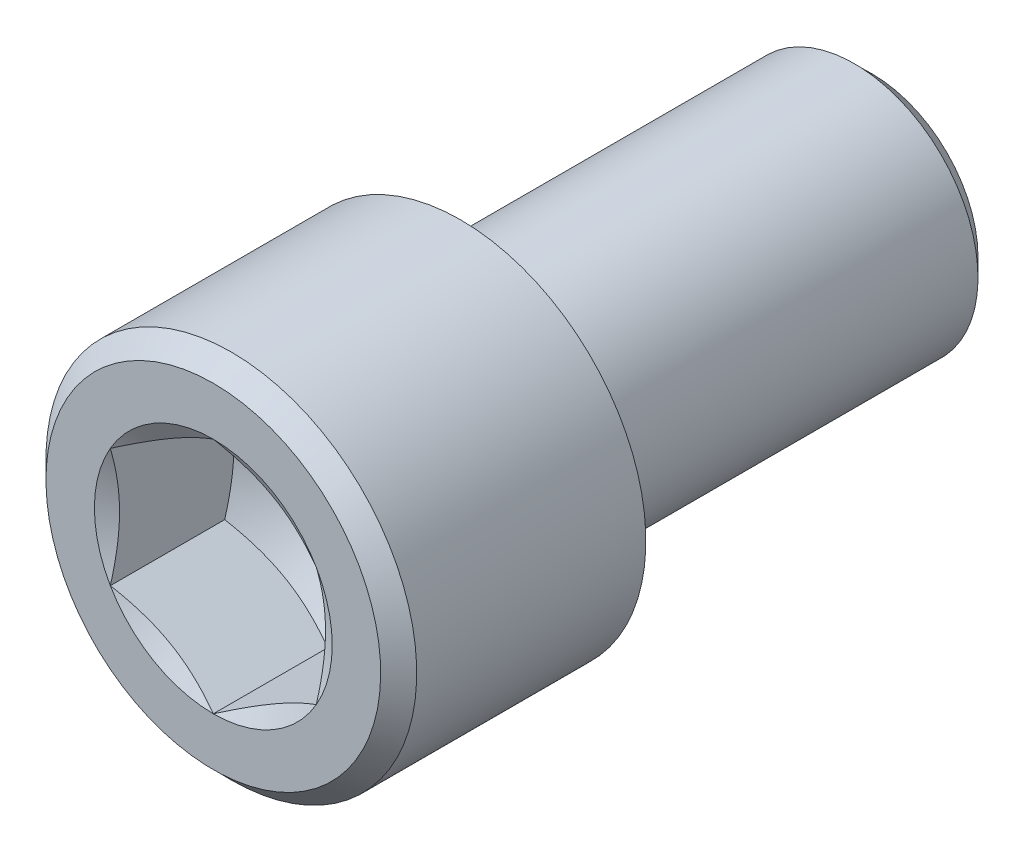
ISO-10303-21;
HEADER;
FILE_DESCRIPTION(('STEP AP214'),'2;1');
FILE_NAME('part.step','',(''),(''),'','','');
FILE_SCHEMA(('AUTOMOTIVE_DESIGN { 1 0 10303 214 1 1 1 1 }'));
ENDSEC;
DATA;
#1=APPLICATION_CONTEXT('core data for automotive mechanical design processes');
#2=APPLICATION_PROTOCOL_DEFINITION('international standard','automotive_design',2000,#1);
#3=PRODUCT_CONTEXT('',#1,'mechanical');
#4=PRODUCT('Part','Part','',(#3));
#5=PRODUCT_RELATED_PRODUCT_CATEGORY('part','',(#4));
#6=PRODUCT_DEFINITION_FORMATION('','',#4);
#7=PRODUCT_DEFINITION_CONTEXT('part definition',#1,'design');
#8=PRODUCT_DEFINITION('design','',#6,#7);
#9=PRODUCT_DEFINITION_SHAPE('','',#8);
#10=(LENGTH_UNIT() NAMED_UNIT(*) SI_UNIT(.MILLI.,.METRE.));
#11=(NAMED_UNIT(*) PLANE_ANGLE_UNIT() SI_UNIT($,.RADIAN.));
#12=(NAMED_UNIT(*) SI_UNIT($,.STERADIAN.) SOLID_ANGLE_UNIT());
#13=UNCERTAINTY_MEASURE_WITH_UNIT(LENGTH_MEASURE(1.E-05),#10,'distance_accuracy_value','');
#14=(GEOMETRIC_REPRESENTATION_CONTEXT(3) GLOBAL_UNCERTAINTY_ASSIGNED_CONTEXT((#13)) GLOBAL_UNIT_ASSIGNED_CONTEXT((#10,
#11,#12)) REPRESENTATION_CONTEXT('',''));
#15=CARTESIAN_POINT('',(0.,0.,0.));
#16=DIRECTION('',(0.,0.,1.));
#17=DIRECTION('',(1.,0.,0.));
#18=AXIS2_PLACEMENT_3D('',#15,#16,#17);
#19=CARTESIAN_POINT('',(0.,9.,12.));
#20=DIRECTION('',(0.,0.,-1.));
#21=DIRECTION('',(0.,1.,0.));
#22=AXIS2_PLACEMENT_3D('',#19,#20,#21);
#23=PLANE('',#22);
#24=CARTESIAN_POINT('',(0.,0.,12.));
#25=DIRECTION('',(0.,0.,-1.));
#26=DIRECTION('',(0.,1.,0.));
#27=AXIS2_PLACEMENT_3D('',#24,#25,#26);
#28=CIRCLE('',#27,8.12499999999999);
#29=CARTESIAN_POINT('',(0.,8.12499999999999,12.));
#30=VERTEX_POINT('',#29);
#31=EDGE_CURVE('E299',#30,#30,#28,.F.);
#32=ORIENTED_EDGE('',*,*,#31,.T.);
#33=EDGE_LOOP('',(#32));
#34=FACE_BOUND('',#33,.T.);
#35=CARTESIAN_POINT('',(0.,0.,12.));
#36=DIRECTION('',(0.,0.,-1.));
#37=DIRECTION('',(0.,1.,0.));
#38=AXIS2_PLACEMENT_3D('',#35,#36,#37);
#39=CIRCLE('',#38,5.77350269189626);
#40=CARTESIAN_POINT('',(0.,5.77350269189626,12.));
#41=VERTEX_POINT('',#40);
#42=CARTESIAN_POINT('',(-5.,2.88675134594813,12.));
#43=VERTEX_POINT('',#42);
#44=EDGE_CURVE('E111',#41,#43,#39,.F.);
#45=ORIENTED_EDGE('',*,*,#44,.F.);
#46=CARTESIAN_POINT('',(5.,2.88675134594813,12.));
#47=VERTEX_POINT('',#46);
#48=EDGE_CURVE('E99',#47,#41,#39,.F.);
#49=ORIENTED_EDGE('',*,*,#48,.F.);
#50=CARTESIAN_POINT('',(5.,-2.88675134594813,12.));
#51=VERTEX_POINT('',#50);
#52=EDGE_CURVE('E109',#51,#47,#39,.F.);
#53=ORIENTED_EDGE('',*,*,#52,.F.);
#54=CARTESIAN_POINT('',(0.,-5.77350269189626,12.));
#55=VERTEX_POINT('',#54);
#56=EDGE_CURVE('E463',#55,#51,#39,.F.);
#57=ORIENTED_EDGE('',*,*,#56,.F.);
#58=CARTESIAN_POINT('',(-5.,-2.88675134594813,12.));
#59=VERTEX_POINT('',#58);
#60=EDGE_CURVE('E145',#59,#55,#39,.F.);
#61=ORIENTED_EDGE('',*,*,#60,.F.);
#62=EDGE_CURVE('E141',#43,#59,#39,.F.);
#63=ORIENTED_EDGE('',*,*,#62,.F.);
#64=EDGE_LOOP('',(#45,#49,#53,#57,#61,#63));
#65=FACE_BOUND('',#64,.T.);
#66=ADVANCED_FACE('F42',(#34,#65),#23,.F.);
#67=CARTESIAN_POINT('',(0.,6.,0.));
#68=DIRECTION('',(0.,0.,1.));
#69=DIRECTION('',(0.,-1.,0.));
#70=AXIS2_PLACEMENT_3D('',#67,#68,#69);
#71=PLANE('',#70);
#72=CARTESIAN_POINT('',(0.,0.,0.));
#73=DIRECTION('',(0.,0.,1.));
#74=DIRECTION('',(0.,-1.,0.));
#75=AXIS2_PLACEMENT_3D('',#72,#73,#74);
#76=CIRCLE('',#75,6.4);
#77=CARTESIAN_POINT('',(0.,-6.4,0.));
#78=VERTEX_POINT('',#77);
#79=EDGE_CURVE('E51',#78,#78,#76,.T.);
#80=ORIENTED_EDGE('',*,*,#79,.T.);
#81=EDGE_LOOP('',(#80));
#82=FACE_BOUND('',#81,.T.);
#83=CARTESIAN_POINT('',(0.,0.,0.));
#84=DIRECTION('',(0.,0.,1.));
#85=DIRECTION('',(0.,-1.,0.));
#86=AXIS2_PLACEMENT_3D('',#83,#84,#85);
#87=CIRCLE('',#86,9.);
#88=CARTESIAN_POINT('',(0.,-9.,0.));
#89=VERTEX_POINT('',#88);
#90=EDGE_CURVE('E431',#89,#89,#87,.T.);
#91=ORIENTED_EDGE('',*,*,#90,.F.);
#92=EDGE_LOOP('',(#91));
#93=FACE_BOUND('',#92,.T.);
#94=ADVANCED_FACE('F259',(#82,#93),#71,.F.);
#95=CARTESIAN_POINT('',(0.,0.,12.));
#96=DIRECTION('',(0.,0.,1.));
#97=DIRECTION('',(0.,-1.,0.));
#98=AXIS2_PLACEMENT_3D('',#95,#96,#97);
#99=CYLINDRICAL_SURFACE('',#98,6.);
#100=CARTESIAN_POINT('',(0.,0.,-0.399999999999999));
#101=DIRECTION('',(0.,0.,1.));
#102=DIRECTION('',(0.,-1.,0.));
#103=AXIS2_PLACEMENT_3D('',#100,#101,#102);
#104=CIRCLE('',#103,6.);
#105=CARTESIAN_POINT('',(0.,-6.,-0.399999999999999));
#106=VERTEX_POINT('',#105);
#107=EDGE_CURVE('E12',#106,#106,#104,.F.);
#108=ORIENTED_EDGE('',*,*,#107,.T.);
#109=EDGE_LOOP('',(#108));
#110=FACE_BOUND('',#109,.T.);
#111=CARTESIAN_POINT('',(0.,0.,-19.125));
#112=DIRECTION('',(0.,0.,1.));
#113=DIRECTION('',(0.,-1.,0.));
#114=AXIS2_PLACEMENT_3D('',#111,#112,#113);
#115=CIRCLE('',#114,6.);
#116=CARTESIAN_POINT('',(0.,-6.,-19.125));
#117=VERTEX_POINT('',#116);
#118=EDGE_CURVE('E289',#117,#117,#115,.T.);
#119=ORIENTED_EDGE('',*,*,#118,.T.);
#120=EDGE_LOOP('',(#119));
#121=FACE_BOUND('',#120,.T.);
#122=ADVANCED_FACE('F263',(#110,#121),#99,.T.);
#123=CARTESIAN_POINT('',(0.,0.,-20.));
#124=DIRECTION('',(0.,0.,1.));
#125=DIRECTION('',(0.,-1.,0.));
#126=AXIS2_PLACEMENT_3D('',#123,#124,#125);
#127=PLANE('',#126);
#128=CARTESIAN_POINT('',(0.,0.,-20.));
#129=DIRECTION('',(0.,0.,1.));
#130=DIRECTION('',(0.,-1.,0.));
#131=AXIS2_PLACEMENT_3D('',#128,#129,#130);
#132=CIRCLE('',#131,5.125);
#133=CARTESIAN_POINT('',(0.,-5.125,-20.));
#134=VERTEX_POINT('',#133);
#135=EDGE_CURVE('E122',#134,#134,#132,.F.);
#136=ORIENTED_EDGE('',*,*,#135,.T.);
#137=EDGE_LOOP('',(#136));
#138=FACE_BOUND('',#137,.T.);
#139=ADVANCED_FACE('F268',(#138),#127,.F.);
#140=CARTESIAN_POINT('',(0.,0.,12.));
#141=DIRECTION('',(0.,0.,1.));
#142=DIRECTION('',(0.,-1.,0.));
#143=AXIS2_PLACEMENT_3D('',#140,#141,#142);
#144=CYLINDRICAL_SURFACE('',#143,9.);
#145=CARTESIAN_POINT('',(0.,0.,11.125));
#146=DIRECTION('',(0.,0.,-1.));
#147=DIRECTION('',(0.,1.,0.));
#148=AXIS2_PLACEMENT_3D('',#145,#146,#147);
#149=CIRCLE('',#148,9.);
#150=CARTESIAN_POINT('',(0.,9.,11.125));
#151=VERTEX_POINT('',#150);
#152=EDGE_CURVE('E292',#151,#151,#149,.T.);
#153=ORIENTED_EDGE('',*,*,#152,.T.);
#154=EDGE_LOOP('',(#153));
#155=FACE_BOUND('',#154,.T.);
#156=ORIENTED_EDGE('',*,*,#90,.T.);
#157=EDGE_LOOP('',(#156));
#158=FACE_BOUND('',#157,.T.);
#159=ADVANCED_FACE('F180',(#155,#158),#144,.T.);
#160=CARTESIAN_POINT('',(0.,0.,12.));
#161=DIRECTION('',(0.,0.,-1.));
#162=DIRECTION('',(0.,1.,0.));
#163=AXIS2_PLACEMENT_3D('',#160,#161,#162);
#164=CONICAL_SURFACE('',#163,8.12499999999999,0.785398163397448);
#165=ORIENTED_EDGE('',*,*,#152,.F.);
#166=EDGE_LOOP('',(#165));
#167=FACE_BOUND('',#166,.T.);
#168=ORIENTED_EDGE('',*,*,#31,.F.);
#169=EDGE_LOOP('',(#168));
#170=FACE_BOUND('',#169,.T.);
#171=ADVANCED_FACE('F275',(#167,#170),#164,.T.);
#172=CARTESIAN_POINT('',(0.,0.,-19.125));
#173=DIRECTION('',(0.,0.,1.));
#174=DIRECTION('',(0.,-1.,0.));
#175=AXIS2_PLACEMENT_3D('',#172,#173,#174);
#176=CONICAL_SURFACE('',#175,6.,0.785398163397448);
#177=ORIENTED_EDGE('',*,*,#135,.F.);
#178=EDGE_LOOP('',(#177));
#179=FACE_BOUND('',#178,.T.);
#180=ORIENTED_EDGE('',*,*,#118,.F.);
#181=EDGE_LOOP('',(#180));
#182=FACE_BOUND('',#181,.T.);
#183=ADVANCED_FACE('F277',(#179,#182),#176,.T.);
#184=CARTESIAN_POINT('',(0.,0.,11.5534180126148));
#185=DIRECTION('',(0.,0.,1.));
#186=DIRECTION('',(0.,-1.,0.));
#187=AXIS2_PLACEMENT_3D('',#184,#185,#186);
#188=CONICAL_SURFACE('',#187,5.,1.04719755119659);
#189=ORIENTED_EDGE('',*,*,#44,.T.);
#190=CARTESIAN_POINT('',(-5.0002,2.88663587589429,12.0000666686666));
#191=CARTESIAN_POINT('',(-4.78046540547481,3.01349970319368,11.9268045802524));
#192=CARTESIAN_POINT('',(-4.55885141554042,3.14144859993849,11.8601693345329));
#193=CARTESIAN_POINT('',(-4.11178600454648,3.39956193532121,11.7438570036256));
#194=CARTESIAN_POINT('',(-3.88632664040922,3.52973095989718,11.6942210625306));
#195=CARTESIAN_POINT('',(-3.43816769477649,3.78847564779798,11.6169690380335));
#196=CARTESIAN_POINT('',(-3.2155379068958,3.91701101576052,11.5888383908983));
#197=CARTESIAN_POINT('',(-2.88081009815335,4.11026620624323,11.5636129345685));
#198=CARTESIAN_POINT('',(-2.76915780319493,4.17472868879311,11.5580314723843));
#199=CARTESIAN_POINT('',(-2.5457500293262,4.30371322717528,11.5526202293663));
#200=CARTESIAN_POINT('',(-2.43399455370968,4.36823528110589,11.552790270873));
#201=CARTESIAN_POINT('',(-2.12781576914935,4.54500768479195,11.5611716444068));
#202=CARTESIAN_POINT('',(-1.93349391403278,4.65719946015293,11.575247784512));
#203=CARTESIAN_POINT('',(-1.54613989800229,4.88083840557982,11.6198832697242));
#204=CARTESIAN_POINT('',(-1.35310909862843,4.99228478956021,11.6504578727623));
#205=CARTESIAN_POINT('',(-0.964974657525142,5.21637431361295,11.726886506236));
#206=CARTESIAN_POINT('',(-0.769920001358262,5.32898917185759,11.7730643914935));
#207=CARTESIAN_POINT('',(-0.38271965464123,5.55253939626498,11.8778698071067));
#208=CARTESIAN_POINT('',(-0.190569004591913,5.66347762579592,11.9364727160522));
#209=CARTESIAN_POINT('',(0.000200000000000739,5.7736181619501,12.0000666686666));
#210=B_SPLINE_CURVE_WITH_KNOTS('',3,(#190,#191,#192,#193,#194,#195,#196,#197,#198,#199,#200,
#201,#202,#203,#204,#205,#206,#207,#208,#209),.UNSPECIFIED.,.F.,.F.,(4,2,2,2,2,2,2,2,2,4),(0.,
0.792555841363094,1.58701660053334,2.36181537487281,2.74884076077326,3.13585419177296,
3.8096236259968,4.4840172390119,5.17336882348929,5.86136694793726),.UNSPECIFIED.);
#211=EDGE_CURVE('E115',#43,#41,#210,.T.);
#212=ORIENTED_EDGE('',*,*,#211,.T.);
#213=EDGE_LOOP('',(#189,#212));
#214=FACE_BOUND('',#213,.T.);
#215=ADVANCED_FACE('F116',(#214),#188,.F.);
#216=ORIENTED_EDGE('',*,*,#62,.T.);
#217=CARTESIAN_POINT('',(-5.,-7.65608998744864,13.9460515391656));
#218=CARTESIAN_POINT('',(-5.,-7.43656171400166,13.8399633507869));
#219=CARTESIAN_POINT('',(-5.,-7.21651440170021,13.7349297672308));
#220=CARTESIAN_POINT('',(-5.,-6.77510105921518,13.5275744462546));
#221=CARTESIAN_POINT('',(-5.,-6.55373480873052,13.4252531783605));
#222=CARTESIAN_POINT('',(-5.,-6.10820714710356,13.2233860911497));
#223=CARTESIAN_POINT('',(-5.,-5.88403698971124,13.1238595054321));
#224=CARTESIAN_POINT('',(-5.,-5.43385418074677,12.9290812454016));
#225=CARTESIAN_POINT('',(-5.,-5.20784162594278,12.8338293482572));
#226=CARTESIAN_POINT('',(-5.,-4.75080884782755,12.6476063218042));
#227=CARTESIAN_POINT('',(-5.,-4.51976121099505,12.5567021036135));
#228=CARTESIAN_POINT('',(-5.,-4.05494053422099,12.3820133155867));
#229=CARTESIAN_POINT('',(-5.,-3.82116719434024,12.2982295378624));
#230=CARTESIAN_POINT('',(-5.,-3.35100416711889,12.1400326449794));
#231=CARTESIAN_POINT('',(-5.,-3.11462125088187,12.0655996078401));
#232=CARTESIAN_POINT('',(-5.,-2.63849247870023,11.9285224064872));
#233=CARTESIAN_POINT('',(-5.,-2.3987477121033,11.8658745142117));
#234=CARTESIAN_POINT('',(-5.,-1.91574303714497,11.7554057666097));
#235=CARTESIAN_POINT('',(-5.,-1.67248221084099,11.7075888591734));
#236=CARTESIAN_POINT('',(-5.,-1.18299359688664,11.6300135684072));
#237=CARTESIAN_POINT('',(-5.,-0.936765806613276,11.6002552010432));
#238=CARTESIAN_POINT('',(-5.,-0.567032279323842,11.5710692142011));
#239=CARTESIAN_POINT('',(-5.,-0.444105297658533,11.5639143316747));
#240=CARTESIAN_POINT('',(-5.,-0.198053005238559,11.5548134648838));
#241=CARTESIAN_POINT('',(-5.,-0.074927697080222,11.5528674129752));
#242=CARTESIAN_POINT('',(-5.,0.17125799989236,11.5542364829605));
#243=CARTESIAN_POINT('',(-5.,0.294318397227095,11.5575501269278));
#244=CARTESIAN_POINT('',(-5.,0.540192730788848,11.5693546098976));
#245=CARTESIAN_POINT('',(-5.,0.66300665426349,11.577845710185));
#246=CARTESIAN_POINT('',(-5.,0.960681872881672,11.6045243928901));
#247=CARTESIAN_POINT('',(-5.,1.1353143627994,11.6253069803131));
#248=CARTESIAN_POINT('',(-5.,1.48321675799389,11.6761836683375));
#249=CARTESIAN_POINT('',(-5.,1.65648647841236,11.7062790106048));
#250=CARTESIAN_POINT('',(-5.,2.00155426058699,11.7747168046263));
#251=CARTESIAN_POINT('',(-5.,2.17335067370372,11.8130674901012));
#252=CARTESIAN_POINT('',(-5.,2.51518168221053,11.8968463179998));
#253=CARTESIAN_POINT('',(-5.,2.68521638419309,11.9422740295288));
#254=CARTESIAN_POINT('',(-5.,3.0277031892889,12.0403057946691));
#255=CARTESIAN_POINT('',(-5.,3.2001124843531,12.0930583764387));
#256=CARTESIAN_POINT('',(-5.,3.54310870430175,12.2037757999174));
#257=CARTESIAN_POINT('',(-5.,3.71369679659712,12.2617370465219));
#258=CARTESIAN_POINT('',(-5.,4.05236610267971,12.3816745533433));
#259=CARTESIAN_POINT('',(-5.,4.22045602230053,12.4436263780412));
#260=CARTESIAN_POINT('',(-5.,4.55533171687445,12.5711662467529));
#261=CARTESIAN_POINT('',(-5.,4.72211693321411,12.6367557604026));
#262=CARTESIAN_POINT('',(-5.,4.88829623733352,12.703804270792));
#263=B_SPLINE_CURVE_WITH_KNOTS('',3,(#217,#218,#219,#220,#221,#222,#223,#224,#225,#226,#227,
#228,#229,#230,#231,#232,#233,#234,#235,#236,#237,#238,#239,#240,#241,#242,#243,#244,#245,#246,
#247,#248,#249,#250,#251,#252,#253,#254,#255,#256,#257,#258,#259,#260,#261,#262),.UNSPECIFIED.,
.F.,.F.,(4,2,2,2,2,2,2,2,2,2,2,2,2,2,2,2,2,2,2,2,2,2,4),(0.,0.731464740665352,1.46305528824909,
2.19883243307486,2.93457117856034,3.67934251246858,4.42419659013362,5.1674358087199,
5.91043951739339,6.65364083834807,7.39684281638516,7.76615414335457,8.13546067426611,
8.50466345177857,8.87388486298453,9.40118542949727,9.92855633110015,10.4564556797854,
10.9843228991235,11.525120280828,12.065547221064,12.6029322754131,13.1405360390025),.UNSPECIFIED.);
#264=EDGE_CURVE('E242',#59,#43,#263,.T.);
#265=ORIENTED_EDGE('',*,*,#264,.T.);
#266=EDGE_LOOP('',(#216,#265));
#267=FACE_BOUND('',#266,.T.);
#268=ADVANCED_FACE('F283',(#267),#188,.F.);
#269=ORIENTED_EDGE('',*,*,#60,.T.);
#270=CARTESIAN_POINT('',(0.000200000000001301,-5.7736181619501,12.0000666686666));
#271=CARTESIAN_POINT('',(-0.219534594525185,-5.64675433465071,11.9268045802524));
#272=CARTESIAN_POINT('',(-0.44114858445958,-5.5188054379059,11.8601693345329));
#273=CARTESIAN_POINT('',(-0.888213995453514,-5.26069210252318,11.7438570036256));
#274=CARTESIAN_POINT('',(-1.11367335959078,-5.13052307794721,11.6942210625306));
#275=CARTESIAN_POINT('',(-1.56183230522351,-4.87177839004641,11.6169690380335));
#276=CARTESIAN_POINT('',(-1.7844620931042,-4.74324302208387,11.5888383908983));
#277=CARTESIAN_POINT('',(-2.11918990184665,-4.54998783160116,11.5636129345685));
#278=CARTESIAN_POINT('',(-2.23084219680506,-4.48552534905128,11.5580314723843));
#279=CARTESIAN_POINT('',(-2.4542499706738,-4.35654081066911,11.5526202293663));
#280=CARTESIAN_POINT('',(-2.56600544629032,-4.2920187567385,11.552790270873));
#281=CARTESIAN_POINT('',(-2.87218423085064,-4.11524635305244,11.5611716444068));
#282=CARTESIAN_POINT('',(-3.06650608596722,-4.00305457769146,11.575247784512));
#283=CARTESIAN_POINT('',(-3.45386010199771,-3.77941563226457,11.6198832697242));
#284=CARTESIAN_POINT('',(-3.64689090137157,-3.66796924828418,11.6504578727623));
#285=CARTESIAN_POINT('',(-4.03502534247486,-3.44387972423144,11.726886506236));
#286=CARTESIAN_POINT('',(-4.23007999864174,-3.3312648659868,11.7730643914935));
#287=CARTESIAN_POINT('',(-4.61728034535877,-3.1077146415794,11.8778698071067));
#288=CARTESIAN_POINT('',(-4.80943099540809,-2.99677641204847,11.9364727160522));
#289=CARTESIAN_POINT('',(-5.0002,-2.88663587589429,12.0000666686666));
#290=B_SPLINE_CURVE_WITH_KNOTS('',3,(#270,#271,#272,#273,#274,#275,#276,#277,#278,#279,#280,
#281,#282,#283,#284,#285,#286,#287,#288,#289),.UNSPECIFIED.,.F.,.F.,(4,2,2,2,2,2,2,2,2,4),(0.,
0.792555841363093,1.58701660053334,2.36181537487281,2.74884076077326,3.13585419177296,
3.8096236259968,4.4840172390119,5.17336882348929,5.86136694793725),.UNSPECIFIED.);
#291=EDGE_CURVE('E235',#55,#59,#290,.T.);
#292=ORIENTED_EDGE('',*,*,#291,.T.);
#293=EDGE_LOOP('',(#269,#292));
#294=FACE_BOUND('',#293,.T.);
#295=ADVANCED_FACE('F377',(#294),#188,.F.);
#296=ORIENTED_EDGE('',*,*,#56,.T.);
#297=CARTESIAN_POINT('',(5.0002,-2.88663587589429,12.0000666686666));
#298=CARTESIAN_POINT('',(4.78046540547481,-3.01349970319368,11.9268045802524));
#299=CARTESIAN_POINT('',(4.55885141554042,-3.14144859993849,11.8601693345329));
#300=CARTESIAN_POINT('',(4.11178600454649,-3.39956193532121,11.7438570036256));
#301=CARTESIAN_POINT('',(3.88632664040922,-3.52973095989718,11.6942210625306));
#302=CARTESIAN_POINT('',(3.43816769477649,-3.78847564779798,11.6169690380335));
#303=CARTESIAN_POINT('',(3.2155379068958,-3.91701101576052,11.5888383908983));
#304=CARTESIAN_POINT('',(2.88081009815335,-4.11026620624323,11.5636129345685));
#305=CARTESIAN_POINT('',(2.76915780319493,-4.17472868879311,11.5580314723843));
#306=CARTESIAN_POINT('',(2.5457500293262,-4.30371322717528,11.5526202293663));
#307=CARTESIAN_POINT('',(2.43399455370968,-4.36823528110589,11.552790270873));
#308=CARTESIAN_POINT('',(2.12781576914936,-4.54500768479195,11.5611716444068));
#309=CARTESIAN_POINT('',(1.93349391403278,-4.65719946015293,11.575247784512));
#310=CARTESIAN_POINT('',(1.54613989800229,-4.88083840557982,11.6198832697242));
#311=CARTESIAN_POINT('',(1.35310909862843,-4.99228478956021,11.6504578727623));
#312=CARTESIAN_POINT('',(0.964974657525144,-5.21637431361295,11.726886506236));
#313=CARTESIAN_POINT('',(0.769920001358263,-5.32898917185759,11.7730643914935));
#314=CARTESIAN_POINT('',(0.382719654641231,-5.55253939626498,11.8778698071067));
#315=CARTESIAN_POINT('',(0.190569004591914,-5.66347762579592,11.9364727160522));
#316=CARTESIAN_POINT('',(-0.00019999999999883,-5.7736181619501,12.0000666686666));
#317=B_SPLINE_CURVE_WITH_KNOTS('',3,(#297,#298,#299,#300,#301,#302,#303,#304,#305,#306,#307,
#308,#309,#310,#311,#312,#313,#314,#315,#316),.UNSPECIFIED.,.F.,.F.,(4,2,2,2,2,2,2,2,2,4),(0.,
0.792555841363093,1.58701660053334,2.36181537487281,2.74884076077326,3.13585419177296,
3.8096236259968,4.4840172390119,5.17336882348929,5.86136694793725),.UNSPECIFIED.);
#318=EDGE_CURVE('E63',#51,#55,#317,.T.);
#319=ORIENTED_EDGE('',*,*,#318,.T.);
#320=EDGE_LOOP('',(#296,#319));
#321=FACE_BOUND('',#320,.T.);
#322=ADVANCED_FACE('F370',(#321),#188,.F.);
#323=ORIENTED_EDGE('',*,*,#52,.T.);
#324=CARTESIAN_POINT('',(5.,-7.65608998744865,13.9460515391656));
#325=CARTESIAN_POINT('',(5.,-7.43656171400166,13.8399633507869));
#326=CARTESIAN_POINT('',(5.,-7.21651440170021,13.7349297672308));
#327=CARTESIAN_POINT('',(5.,-6.77510105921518,13.5275744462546));
#328=CARTESIAN_POINT('',(5.,-6.55373480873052,13.4252531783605));
#329=CARTESIAN_POINT('',(5.,-6.10820714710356,13.2233860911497));
#330=CARTESIAN_POINT('',(5.,-5.88403698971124,13.1238595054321));
#331=CARTESIAN_POINT('',(5.,-5.43385418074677,12.9290812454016));
#332=CARTESIAN_POINT('',(5.,-5.20784162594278,12.8338293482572));
#333=CARTESIAN_POINT('',(5.,-4.75080884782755,12.6476063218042));
#334=CARTESIAN_POINT('',(5.,-4.51976121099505,12.5567021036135));
#335=CARTESIAN_POINT('',(5.,-4.05494053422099,12.3820133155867));
#336=CARTESIAN_POINT('',(5.,-3.82116719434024,12.2982295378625));
#337=CARTESIAN_POINT('',(5.,-3.35100416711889,12.1400326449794));
#338=CARTESIAN_POINT('',(5.,-3.11462125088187,12.0655996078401));
#339=CARTESIAN_POINT('',(5.,-2.63849247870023,11.9285224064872));
#340=CARTESIAN_POINT('',(5.,-2.3987477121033,11.8658745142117));
#341=CARTESIAN_POINT('',(5.,-1.91574303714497,11.7554057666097));
#342=CARTESIAN_POINT('',(5.,-1.67248221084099,11.7075888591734));
#343=CARTESIAN_POINT('',(5.,-1.18299359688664,11.6300135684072));
#344=CARTESIAN_POINT('',(5.,-0.936765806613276,11.6002552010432));
#345=CARTESIAN_POINT('',(5.,-0.567032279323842,11.5710692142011));
#346=CARTESIAN_POINT('',(5.,-0.444105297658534,11.5639143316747));
#347=CARTESIAN_POINT('',(5.,-0.198053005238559,11.5548134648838));
#348=CARTESIAN_POINT('',(5.,-0.0749276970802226,11.5528674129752));
#349=CARTESIAN_POINT('',(5.,0.17125799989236,11.5542364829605));
#350=CARTESIAN_POINT('',(5.,0.294318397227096,11.5575501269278));
#351=CARTESIAN_POINT('',(5.,0.540192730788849,11.5693546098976));
#352=CARTESIAN_POINT('',(5.,0.663006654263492,11.577845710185));
#353=CARTESIAN_POINT('',(5.,0.960681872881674,11.6045243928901));
#354=CARTESIAN_POINT('',(5.,1.1353143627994,11.6253069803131));
#355=CARTESIAN_POINT('',(5.,1.48321675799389,11.6761836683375));
#356=CARTESIAN_POINT('',(5.,1.65648647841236,11.7062790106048));
#357=CARTESIAN_POINT('',(5.,2.00155426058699,11.7747168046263));
#358=CARTESIAN_POINT('',(5.,2.17335067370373,11.8130674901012));
#359=CARTESIAN_POINT('',(5.,2.51518168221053,11.8968463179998));
#360=CARTESIAN_POINT('',(5.,2.6852163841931,11.9422740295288));
#361=CARTESIAN_POINT('',(5.,3.02770318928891,12.0403057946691));
#362=CARTESIAN_POINT('',(5.,3.20011248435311,12.0930583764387));
#363=CARTESIAN_POINT('',(5.,3.54310870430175,12.2037757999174));
#364=CARTESIAN_POINT('',(5.,3.71369679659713,12.2617370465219));
#365=CARTESIAN_POINT('',(5.,4.05236610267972,12.3816745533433));
#366=CARTESIAN_POINT('',(5.,4.22045602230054,12.4436263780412));
#367=CARTESIAN_POINT('',(5.,4.55533171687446,12.5711662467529));
#368=CARTESIAN_POINT('',(5.,4.72211693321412,12.6367557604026));
#369=CARTESIAN_POINT('',(5.,4.88829623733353,12.703804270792));
#370=B_SPLINE_CURVE_WITH_KNOTS('',3,(#324,#325,#326,#327,#328,#329,#330,#331,#332,#333,#334,
#335,#336,#337,#338,#339,#340,#341,#342,#343,#344,#345,#346,#347,#348,#349,#350,#351,#352,#353,
#354,#355,#356,#357,#358,#359,#360,#361,#362,#363,#364,#365,#366,#367,#368,#369),.UNSPECIFIED.,
.F.,.F.,(4,2,2,2,2,2,2,2,2,2,2,2,2,2,2,2,2,2,2,2,2,2,4),(0.,0.731464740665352,1.46305528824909,
2.19883243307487,2.93457117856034,3.67934251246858,4.42419659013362,5.1674358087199,
5.91043951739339,6.65364083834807,7.39684281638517,7.76615414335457,8.13546067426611,
8.50466345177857,8.87388486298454,9.40118542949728,9.92855633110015,10.4564556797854,
10.9843228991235,11.525120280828,12.065547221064,12.6029322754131,13.1405360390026),.UNSPECIFIED.);
#371=EDGE_CURVE('E57',#47,#51,#370,.F.);
#372=ORIENTED_EDGE('',*,*,#371,.T.);
#373=EDGE_LOOP('',(#323,#372));
#374=FACE_BOUND('',#373,.T.);
#375=ADVANCED_FACE('F363',(#374),#188,.F.);
#376=ORIENTED_EDGE('',*,*,#48,.T.);
#377=CARTESIAN_POINT('',(-0.000200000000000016,5.7736181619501,12.0000666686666));
#378=CARTESIAN_POINT('',(0.219534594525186,5.64675433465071,11.9268045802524));
#379=CARTESIAN_POINT('',(0.441148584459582,5.5188054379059,11.8601693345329));
#380=CARTESIAN_POINT('',(0.888213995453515,5.26069210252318,11.7438570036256));
#381=CARTESIAN_POINT('',(1.11367335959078,5.13052307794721,11.6942210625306));
#382=CARTESIAN_POINT('',(1.56183230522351,4.87177839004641,11.6169690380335));
#383=CARTESIAN_POINT('',(1.7844620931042,4.74324302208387,11.5888383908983));
#384=CARTESIAN_POINT('',(2.11918990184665,4.54998783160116,11.5636129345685));
#385=CARTESIAN_POINT('',(2.23084219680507,4.48552534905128,11.5580314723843));
#386=CARTESIAN_POINT('',(2.4542499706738,4.35654081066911,11.5526202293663));
#387=CARTESIAN_POINT('',(2.56600544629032,4.2920187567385,11.552790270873));
#388=CARTESIAN_POINT('',(2.87218423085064,4.11524635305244,11.5611716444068));
#389=CARTESIAN_POINT('',(3.06650608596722,4.00305457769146,11.575247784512));
#390=CARTESIAN_POINT('',(3.45386010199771,3.77941563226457,11.6198832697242));
#391=CARTESIAN_POINT('',(3.64689090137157,3.66796924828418,11.6504578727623));
#392=CARTESIAN_POINT('',(4.03502534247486,3.44387972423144,11.726886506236));
#393=CARTESIAN_POINT('',(4.23007999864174,3.3312648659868,11.7730643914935));
#394=CARTESIAN_POINT('',(4.61728034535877,3.10771464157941,11.8778698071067));
#395=CARTESIAN_POINT('',(4.80943099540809,2.99677641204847,11.9364727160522));
#396=CARTESIAN_POINT('',(5.0002,2.88663587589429,12.0000666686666));
#397=B_SPLINE_CURVE_WITH_KNOTS('',3,(#377,#378,#379,#380,#381,#382,#383,#384,#385,#386,#387,
#388,#389,#390,#391,#392,#393,#394,#395,#396),.UNSPECIFIED.,.F.,.F.,(4,2,2,2,2,2,2,2,2,4),(0.,
0.792555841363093,1.58701660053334,2.36181537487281,2.74884076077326,3.13585419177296,
3.8096236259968,4.4840172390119,5.17336882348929,5.86136694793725),.UNSPECIFIED.);
#398=EDGE_CURVE('E103',#41,#47,#397,.T.);
#399=ORIENTED_EDGE('',*,*,#398,.T.);
#400=EDGE_LOOP('',(#376,#399));
#401=FACE_BOUND('',#400,.T.);
#402=ADVANCED_FACE('F101',(#401),#188,.F.);
#403=CARTESIAN_POINT('',(0.,0.,3.11324865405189));
#404=DIRECTION('',(0.,0.,1.));
#405=DIRECTION('',(1.,0.,0.));
#406=AXIS2_PLACEMENT_3D('',#403,#404,#405);
#407=CONICAL_SURFACE('',#406,0.,1.0471975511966);
#408=CARTESIAN_POINT('',(5.0002,-2.88663587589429,6.44664865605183));
#409=CARTESIAN_POINT('',(4.78046540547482,-3.01349970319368,6.37338656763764));
#410=CARTESIAN_POINT('',(4.55885141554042,-3.14144859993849,6.30675132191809));
#411=CARTESIAN_POINT('',(4.11178600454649,-3.39956193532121,6.19043899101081));
#412=CARTESIAN_POINT('',(3.88632664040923,-3.52973095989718,6.14080304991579));
#413=CARTESIAN_POINT('',(3.43816769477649,-3.78847564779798,6.0635510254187));
#414=CARTESIAN_POINT('',(3.21553790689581,-3.91701101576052,6.03542037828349));
#415=CARTESIAN_POINT('',(2.88081009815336,-4.11026620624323,6.01019492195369));
#416=CARTESIAN_POINT('',(2.76915780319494,-4.17472868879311,6.00461345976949));
#417=CARTESIAN_POINT('',(2.5457500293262,-4.30371322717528,5.99920221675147));
#418=CARTESIAN_POINT('',(2.43399455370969,-4.36823528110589,5.99937225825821));
#419=CARTESIAN_POINT('',(2.12781576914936,-4.54500768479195,6.00775363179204));
#420=CARTESIAN_POINT('',(1.93349391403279,-4.65719946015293,6.02182977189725));
#421=CARTESIAN_POINT('',(1.5461398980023,-4.88083840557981,6.06646525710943));
#422=CARTESIAN_POINT('',(1.35310909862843,-4.9922847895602,6.09703986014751));
#423=CARTESIAN_POINT('',(0.964974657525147,-5.21637431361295,6.17346849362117));
#424=CARTESIAN_POINT('',(0.769920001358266,-5.32898917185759,6.21964637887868));
#425=CARTESIAN_POINT('',(0.382719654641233,-5.55253939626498,6.32445179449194));
#426=CARTESIAN_POINT('',(0.190569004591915,-5.66347762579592,6.38305470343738));
#427=CARTESIAN_POINT('',(-0.000199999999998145,-5.7736181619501,6.44664865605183));
#428=B_SPLINE_CURVE_WITH_KNOTS('',3,(#408,#409,#410,#411,#412,#413,#414,#415,#416,#417,#418,
#419,#420,#421,#422,#423,#424,#425,#426,#427),.UNSPECIFIED.,.F.,.F.,(4,2,2,2,2,2,2,2,2,4),(0.,
0.792555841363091,1.58701660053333,2.36181537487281,2.74884076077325,3.13585419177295,
3.80962362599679,4.48401723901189,5.17336882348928,5.86136694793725),.UNSPECIFIED.);
#429=CARTESIAN_POINT('',(5.,-2.88675134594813,6.4465819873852));
#430=VERTEX_POINT('',#429);
#431=CARTESIAN_POINT('',(0.,-5.77350269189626,6.4465819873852));
#432=VERTEX_POINT('',#431);
#433=EDGE_CURVE('E194',#430,#432,#428,.T.);
#434=ORIENTED_EDGE('',*,*,#433,.F.);
#435=CARTESIAN_POINT('',(5.,-7.71798195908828,8.42258776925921));
#436=CARTESIAN_POINT('',(5.,-7.49970384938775,8.31684955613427));
#437=CARTESIAN_POINT('',(5.,-7.28092032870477,8.21213656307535));
#438=CARTESIAN_POINT('',(5.,-6.84207314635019,8.00533908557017));
#439=CARTESIAN_POINT('',(5.,-6.62200928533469,7.90325502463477));
#440=CARTESIAN_POINT('',(5.,-6.17918315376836,7.70177322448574));
#441=CARTESIAN_POINT('',(5.,-5.95641269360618,7.60239342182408));
#442=CARTESIAN_POINT('',(5.,-5.50908481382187,7.40775599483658));
#443=CARTESIAN_POINT('',(5.,-5.28452748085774,7.31249817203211));
#444=CARTESIAN_POINT('',(5.,-4.82657046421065,7.12444529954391));
#445=CARTESIAN_POINT('',(5.,-4.59310603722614,7.03180704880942));
#446=CARTESIAN_POINT('',(5.,-4.12343378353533,6.85362983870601));
#447=CARTESIAN_POINT('',(5.,-3.88722565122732,6.76809167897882));
#448=CARTESIAN_POINT('',(5.,-3.41214208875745,6.60638364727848));
#449=CARTESIAN_POINT('',(5.,-3.17327325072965,6.53019460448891));
#450=CARTESIAN_POINT('',(5.,-2.69211227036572,6.38965132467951));
#451=CARTESIAN_POINT('',(5.,-2.44982124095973,6.32529333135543));
#452=CARTESIAN_POINT('',(5.,-1.96281641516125,6.21181328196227));
#453=CARTESIAN_POINT('',(5.,-1.71811906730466,6.16262194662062));
#454=CARTESIAN_POINT('',(5.,-1.22572466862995,6.08235290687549));
#455=CARTESIAN_POINT('',(5.,-0.978027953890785,6.05127319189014));
#456=CARTESIAN_POINT('',(5.,-0.484068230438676,6.01011095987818));
#457=CARTESIAN_POINT('',(5.,-0.23782790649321,5.99976291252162));
#458=CARTESIAN_POINT('',(5.,0.254662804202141,6.00024526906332));
#459=CARTESIAN_POINT('',(5.,0.500913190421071,6.01107718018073));
#460=CARTESIAN_POINT('',(5.,0.919771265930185,6.0467554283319));
#461=CARTESIAN_POINT('',(5.,1.09283273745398,6.06657048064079));
#462=CARTESIAN_POINT('',(5.,1.43765967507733,6.11541146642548));
#463=CARTESIAN_POINT('',(5.,1.6094249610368,6.14443865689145));
#464=CARTESIAN_POINT('',(5.,2.12253233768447,6.24380732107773));
#465=CARTESIAN_POINT('',(5.,2.46152279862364,6.32642017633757));
#466=CARTESIAN_POINT('',(5.,2.96891814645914,6.46943410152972));
#467=CARTESIAN_POINT('',(5.,3.13995004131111,6.52104080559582));
#468=CARTESIAN_POINT('',(5.,3.48034882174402,6.62952941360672));
#469=CARTESIAN_POINT('',(5.,3.6497156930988,6.68641136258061));
#470=CARTESIAN_POINT('',(5.,3.98685300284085,6.80454695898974));
#471=CARTESIAN_POINT('',(5.,4.15462385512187,6.86579943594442));
#472=CARTESIAN_POINT('',(5.,4.4887736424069,6.99195640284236));
#473=CARTESIAN_POINT('',(5.,4.65515264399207,7.05686071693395));
#474=CARTESIAN_POINT('',(5.,5.03780012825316,7.21019970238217));
#475=CARTESIAN_POINT('',(5.,5.25363308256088,7.29971897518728));
#476=CARTESIAN_POINT('',(5.,5.68353815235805,7.48290118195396));
#477=CARTESIAN_POINT('',(5.,5.8976101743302,7.57656433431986));
#478=CARTESIAN_POINT('',(5.,6.3243108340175,7.76723069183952));
#479=CARTESIAN_POINT('',(5.,6.53693916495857,7.86423458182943));
#480=CARTESIAN_POINT('',(5.,6.96094691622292,8.06093838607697));
#481=CARTESIAN_POINT('',(5.,7.17232631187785,8.16063835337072));
#482=CARTESIAN_POINT('',(5.,7.8051822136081,8.46315747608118));
#483=CARTESIAN_POINT('',(5.,8.22508620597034,8.6692644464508));
#484=CARTESIAN_POINT('',(5.,9.06189522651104,9.08747898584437));
#485=CARTESIAN_POINT('',(5.,9.47880014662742,9.29958676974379));
#486=CARTESIAN_POINT('',(5.,10.1030029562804,9.6212414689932));
#487=CARTESIAN_POINT('',(5.,10.3111335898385,9.72917688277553));
#488=CARTESIAN_POINT('',(5.,10.7269054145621,9.94597692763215));
#489=CARTESIAN_POINT('',(5.,10.9345466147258,10.0548415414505));
#490=CARTESIAN_POINT('',(5.,11.5568548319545,10.3826356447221));
#491=CARTESIAN_POINT('',(5.,11.9708932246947,10.6027585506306));
#492=CARTESIAN_POINT('',(5.,12.7975006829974,11.0452965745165));
#493=CARTESIAN_POINT('',(5.,13.2100703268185,11.2677106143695));
#494=CARTESIAN_POINT('',(5.,14.0342065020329,11.7143889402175));
#495=CARTESIAN_POINT('',(5.,14.4457730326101,11.938653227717));
#496=CARTESIAN_POINT('',(5.,15.5473863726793,12.5414417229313));
#497=CARTESIAN_POINT('',(5.,16.2367129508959,12.9212816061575));
#498=CARTESIAN_POINT('',(5.,17.6138948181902,13.6838290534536));
#499=CARTESIAN_POINT('',(5.,18.3017499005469,14.0665369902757));
#500=CARTESIAN_POINT('',(5.,19.6733327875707,14.8323143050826));
#501=CARTESIAN_POINT('',(5.,20.3570655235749,15.2153748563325));
#502=CARTESIAN_POINT('',(5.,21.7235737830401,15.9829746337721));
#503=CARTESIAN_POINT('',(5.,22.4063494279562,16.3675136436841));
#504=CARTESIAN_POINT('',(5.,23.0888270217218,16.752578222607));
#505=B_SPLINE_CURVE_WITH_KNOTS('',3,(#435,#436,#437,#438,#439,#440,#441,#442,#443,#444,#445,
#446,#447,#448,#449,#450,#451,#452,#453,#454,#455,#456,#457,#458,#459,#460,#461,#462,#463,#464,
#465,#466,#467,#468,#469,#470,#471,#472,#473,#474,#475,#476,#477,#478,#479,#480,#481,#482,#483,
#484,#485,#486,#487,#488,#489,#490,#491,#492,#493,#494,#495,#496,#497,#498,#499,#500,#501,#502,
#503,#504),.UNSPECIFIED.,.F.,.F.,(4,2,2,2,2,2,2,2,2,2,2,2,2,2,2,2,2,2,2,2,2,2,2,2,2,2,2,2,2,2,2,
2,2,2,4),(0.,0.727630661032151,1.4553778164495,2.18714166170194,2.91887023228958,
3.67229766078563,4.4258098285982,5.17775010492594,5.92945122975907,6.67766599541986,
7.42579768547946,8.16428446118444,8.90282379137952,9.42514706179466,9.9475416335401,
10.9928202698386,11.5287200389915,12.0646243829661,12.6003857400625,13.1361213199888,
13.8370477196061,14.5380111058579,15.2391190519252,15.9402407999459,17.3434398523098,
18.7466892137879,19.4500474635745,20.1533926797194,21.5601278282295,22.9662287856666,
24.3723308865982,26.7334735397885,29.0949285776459,31.4461031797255,33.796946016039),.UNSPECIFIED.);
#506=CARTESIAN_POINT('',(5.,2.88675134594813,6.4465819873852));
#507=VERTEX_POINT('',#506);
#508=EDGE_CURVE('E201',#507,#430,#505,.F.);
#509=ORIENTED_EDGE('',*,*,#508,.F.);
#510=CARTESIAN_POINT('',(-0.000200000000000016,5.7736181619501,6.44664865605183));
#511=CARTESIAN_POINT('',(0.219534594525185,5.64675433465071,6.37338656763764));
#512=CARTESIAN_POINT('',(0.441148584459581,5.5188054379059,6.30675132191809));
#513=CARTESIAN_POINT('',(0.888213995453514,5.26069210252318,6.19043899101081));
#514=CARTESIAN_POINT('',(1.11367335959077,5.13052307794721,6.14080304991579));
#515=CARTESIAN_POINT('',(1.56183230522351,4.87177839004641,6.0635510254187));
#516=CARTESIAN_POINT('',(1.78446209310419,4.74324302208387,6.03542037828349));
#517=CARTESIAN_POINT('',(2.11918990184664,4.54998783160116,6.01019492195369));
#518=CARTESIAN_POINT('',(2.23084219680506,4.48552534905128,6.00461345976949));
#519=CARTESIAN_POINT('',(2.4542499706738,4.35654081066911,5.99920221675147));
#520=CARTESIAN_POINT('',(2.56600544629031,4.2920187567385,5.99937225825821));
#521=CARTESIAN_POINT('',(2.87218423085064,4.11524635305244,6.00775363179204));
#522=CARTESIAN_POINT('',(3.06650608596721,4.00305457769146,6.02182977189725));
#523=CARTESIAN_POINT('',(3.45386010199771,3.77941563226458,6.06646525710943));
#524=CARTESIAN_POINT('',(3.64689090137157,3.66796924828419,6.09703986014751));
#525=CARTESIAN_POINT('',(4.03502534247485,3.44387972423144,6.17346849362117));
#526=CARTESIAN_POINT('',(4.23007999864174,3.3312648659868,6.21964637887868));
#527=CARTESIAN_POINT('',(4.61728034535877,3.10771464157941,6.32445179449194));
#528=CARTESIAN_POINT('',(4.80943099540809,2.99677641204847,6.38305470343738));
#529=CARTESIAN_POINT('',(5.0002,2.88663587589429,6.44664865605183));
#530=B_SPLINE_CURVE_WITH_KNOTS('',3,(#510,#511,#512,#513,#514,#515,#516,#517,#518,#519,#520,
#521,#522,#523,#524,#525,#526,#527,#528,#529),.UNSPECIFIED.,.F.,.F.,(4,2,2,2,2,2,2,2,2,4),(0.,
0.792555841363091,1.58701660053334,2.36181537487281,2.74884076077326,3.13585419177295,
3.80962362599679,4.48401723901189,5.17336882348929,5.86136694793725),.UNSPECIFIED.);
#531=CARTESIAN_POINT('',(0.,5.77350269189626,6.4465819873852));
#532=VERTEX_POINT('',#531);
#533=EDGE_CURVE('E209',#532,#507,#530,.T.);
#534=ORIENTED_EDGE('',*,*,#533,.F.);
#535=CARTESIAN_POINT('',(-5.0002,2.88663587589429,6.44664865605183));
#536=CARTESIAN_POINT('',(-4.78046540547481,3.01349970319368,6.37338656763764));
#537=CARTESIAN_POINT('',(-4.55885141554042,3.14144859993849,6.30675132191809));
#538=CARTESIAN_POINT('',(-4.11178600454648,3.39956193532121,6.19043899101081));
#539=CARTESIAN_POINT('',(-3.88632664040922,3.52973095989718,6.14080304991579));
#540=CARTESIAN_POINT('',(-3.43816769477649,3.78847564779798,6.0635510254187));
#541=CARTESIAN_POINT('',(-3.21553790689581,3.91701101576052,6.03542037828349));
#542=CARTESIAN_POINT('',(-2.88081009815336,4.11026620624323,6.01019492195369));
#543=CARTESIAN_POINT('',(-2.76915780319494,4.17472868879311,6.00461345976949));
#544=CARTESIAN_POINT('',(-2.5457500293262,4.30371322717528,5.99920221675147));
#545=CARTESIAN_POINT('',(-2.43399455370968,4.36823528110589,5.99937225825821));
#546=CARTESIAN_POINT('',(-2.12781576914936,4.54500768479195,6.00775363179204));
#547=CARTESIAN_POINT('',(-1.93349391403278,4.65719946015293,6.02182977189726));
#548=CARTESIAN_POINT('',(-1.54613989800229,4.88083840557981,6.06646525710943));
#549=CARTESIAN_POINT('',(-1.35310909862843,4.9922847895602,6.09703986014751));
#550=CARTESIAN_POINT('',(-0.964974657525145,5.21637431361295,6.17346849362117));
#551=CARTESIAN_POINT('',(-0.769920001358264,5.32898917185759,6.21964637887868));
#552=CARTESIAN_POINT('',(-0.382719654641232,5.55253939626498,6.32445179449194));
#553=CARTESIAN_POINT('',(-0.190569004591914,5.66347762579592,6.38305470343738));
#554=CARTESIAN_POINT('',(0.000200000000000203,5.7736181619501,6.44664865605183));
#555=B_SPLINE_CURVE_WITH_KNOTS('',3,(#535,#536,#537,#538,#539,#540,#541,#542,#543,#544,#545,
#546,#547,#548,#549,#550,#551,#552,#553,#554),.UNSPECIFIED.,.F.,.F.,(4,2,2,2,2,2,2,2,2,4),(0.,
0.792555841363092,1.58701660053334,2.36181537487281,2.74884076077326,3.13585419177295,
3.80962362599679,4.48401723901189,5.17336882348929,5.86136694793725),.UNSPECIFIED.);
#556=CARTESIAN_POINT('',(-5.,2.88675134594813,6.4465819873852));
#557=VERTEX_POINT('',#556);
#558=EDGE_CURVE('E134',#557,#532,#555,.T.);
#559=ORIENTED_EDGE('',*,*,#558,.F.);
#560=CARTESIAN_POINT('',(-5.,-7.71798195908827,8.4225877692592));
#561=CARTESIAN_POINT('',(-5.,-7.49970384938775,8.31684955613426));
#562=CARTESIAN_POINT('',(-5.,-7.28092032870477,8.21213656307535));
#563=CARTESIAN_POINT('',(-5.,-6.84207314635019,8.00533908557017));
#564=CARTESIAN_POINT('',(-5.,-6.62200928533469,7.90325502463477));
#565=CARTESIAN_POINT('',(-5.,-6.17918315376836,7.70177322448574));
#566=CARTESIAN_POINT('',(-5.,-5.95641269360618,7.60239342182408));
#567=CARTESIAN_POINT('',(-5.,-5.50908481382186,7.40775599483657));
#568=CARTESIAN_POINT('',(-5.,-5.28452748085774,7.31249817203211));
#569=CARTESIAN_POINT('',(-5.,-4.82657046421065,7.12444529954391));
#570=CARTESIAN_POINT('',(-5.,-4.59310603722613,7.03180704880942));
#571=CARTESIAN_POINT('',(-5.,-4.12343378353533,6.85362983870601));
#572=CARTESIAN_POINT('',(-5.,-3.88722565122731,6.76809167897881));
#573=CARTESIAN_POINT('',(-5.,-3.41214208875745,6.60638364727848));
#574=CARTESIAN_POINT('',(-5.,-3.17327325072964,6.53019460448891));
#575=CARTESIAN_POINT('',(-5.,-2.69211227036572,6.38965132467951));
#576=CARTESIAN_POINT('',(-5.,-2.44982124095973,6.32529333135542));
#577=CARTESIAN_POINT('',(-5.,-1.96281641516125,6.21181328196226));
#578=CARTESIAN_POINT('',(-5.,-1.71811906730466,6.16262194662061));
#579=CARTESIAN_POINT('',(-5.,-1.22572466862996,6.08235290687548));
#580=CARTESIAN_POINT('',(-5.,-0.978027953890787,6.05127319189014));
#581=CARTESIAN_POINT('',(-5.,-0.484068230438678,6.01011095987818));
#582=CARTESIAN_POINT('',(-5.,-0.237827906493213,5.99976291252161));
#583=CARTESIAN_POINT('',(-5.,0.254662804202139,6.00024526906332));
#584=CARTESIAN_POINT('',(-5.,0.500913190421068,6.01107718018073));
#585=CARTESIAN_POINT('',(-5.,0.919771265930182,6.0467554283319));
#586=CARTESIAN_POINT('',(-5.,1.09283273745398,6.06657048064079));
#587=CARTESIAN_POINT('',(-5.,1.43765967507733,6.11541146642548));
#588=CARTESIAN_POINT('',(-5.,1.6094249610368,6.14443865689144));
#589=CARTESIAN_POINT('',(-5.,2.12253233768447,6.24380732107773));
#590=CARTESIAN_POINT('',(-5.,2.46152279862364,6.32642017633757));
#591=CARTESIAN_POINT('',(-5.,2.96891814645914,6.46943410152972));
#592=CARTESIAN_POINT('',(-5.,3.13995004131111,6.52104080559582));
#593=CARTESIAN_POINT('',(-5.,3.48034882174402,6.62952941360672));
#594=CARTESIAN_POINT('',(-5.,3.6497156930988,6.68641136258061));
#595=CARTESIAN_POINT('',(-5.,3.98685300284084,6.80454695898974));
#596=CARTESIAN_POINT('',(-5.,4.15462385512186,6.86579943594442));
#597=CARTESIAN_POINT('',(-5.,4.48877364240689,6.99195640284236));
#598=CARTESIAN_POINT('',(-5.,4.65515264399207,7.05686071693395));
#599=CARTESIAN_POINT('',(-5.,5.03780012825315,7.21019970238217));
#600=CARTESIAN_POINT('',(-5.,5.25363308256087,7.29971897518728));
#601=CARTESIAN_POINT('',(-5.,5.68353815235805,7.48290118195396));
#602=CARTESIAN_POINT('',(-5.,5.89761017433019,7.57656433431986));
#603=CARTESIAN_POINT('',(-5.,6.3243108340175,7.76723069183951));
#604=CARTESIAN_POINT('',(-5.,6.53693916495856,7.86423458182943));
#605=CARTESIAN_POINT('',(-5.,6.96094691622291,8.06093838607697));
#606=CARTESIAN_POINT('',(-5.,7.17232631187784,8.16063835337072));
#607=CARTESIAN_POINT('',(-5.,7.80518221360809,8.46315747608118));
#608=CARTESIAN_POINT('',(-5.,8.22508620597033,8.66926444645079));
#609=CARTESIAN_POINT('',(-5.,9.06189522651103,9.08747898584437));
#610=CARTESIAN_POINT('',(-5.,9.4788001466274,9.29958676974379));
#611=CARTESIAN_POINT('',(-5.,10.1030029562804,9.6212414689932));
#612=CARTESIAN_POINT('',(-5.,10.3111335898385,9.72917688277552));
#613=CARTESIAN_POINT('',(-5.,10.7269054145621,9.94597692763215));
#614=CARTESIAN_POINT('',(-5.,10.9345466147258,10.0548415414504));
#615=CARTESIAN_POINT('',(-5.,11.5568548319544,10.3826356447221));
#616=CARTESIAN_POINT('',(-5.,11.9708932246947,10.6027585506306));
#617=CARTESIAN_POINT('',(-5.,12.7975006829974,11.0452965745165));
#618=CARTESIAN_POINT('',(-5.,13.2100703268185,11.2677106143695));
#619=CARTESIAN_POINT('',(-5.,14.0342065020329,11.7143889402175));
#620=CARTESIAN_POINT('',(-5.,14.4457730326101,11.938653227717));
#621=CARTESIAN_POINT('',(-5.,15.5473863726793,12.5414417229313));
#622=CARTESIAN_POINT('',(-5.,16.2367129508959,12.9212816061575));
#623=CARTESIAN_POINT('',(-5.,17.6138948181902,13.6838290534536));
#624=CARTESIAN_POINT('',(-5.00000000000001,18.3017499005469,14.0665369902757));
#625=CARTESIAN_POINT('',(-5.00000000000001,19.6733327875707,14.8323143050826));
#626=CARTESIAN_POINT('',(-5.00000000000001,20.3570655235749,15.2153748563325));
#627=CARTESIAN_POINT('',(-5.00000000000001,21.7235737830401,15.982974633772));
#628=CARTESIAN_POINT('',(-5.00000000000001,22.4063494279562,16.3675136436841));
#629=CARTESIAN_POINT('',(-5.00000000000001,23.0888270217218,16.752578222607));
#630=B_SPLINE_CURVE_WITH_KNOTS('',3,(#560,#561,#562,#563,#564,#565,#566,#567,#568,#569,#570,
#571,#572,#573,#574,#575,#576,#577,#578,#579,#580,#581,#582,#583,#584,#585,#586,#587,#588,#589,
#590,#591,#592,#593,#594,#595,#596,#597,#598,#599,#600,#601,#602,#603,#604,#605,#606,#607,#608,
#609,#610,#611,#612,#613,#614,#615,#616,#617,#618,#619,#620,#621,#622,#623,#624,#625,#626,#627,
#628,#629),.UNSPECIFIED.,.F.,.F.,(4,2,2,2,2,2,2,2,2,2,2,2,2,2,2,2,2,2,2,2,2,2,2,2,2,2,2,2,2,2,2,
2,2,2,4),(0.,0.727630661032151,1.4553778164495,2.18714166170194,2.91887023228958,
3.67229766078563,4.4258098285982,5.17775010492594,5.92945122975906,6.67766599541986,
7.42579768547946,8.16428446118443,8.90282379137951,9.42514706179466,9.9475416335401,
10.9928202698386,11.5287200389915,12.0646243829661,12.6003857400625,13.1361213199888,
13.8370477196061,14.5380111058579,15.2391190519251,15.9402407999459,17.3434398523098,
18.7466892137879,19.4500474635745,20.1533926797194,21.5601278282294,22.9662287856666,
24.3723308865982,26.7334735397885,29.0949285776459,31.4461031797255,33.796946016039),.UNSPECIFIED.);
#631=CARTESIAN_POINT('',(-5.,-2.88675134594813,6.4465819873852));
#632=VERTEX_POINT('',#631);
#633=EDGE_CURVE('E154',#632,#557,#630,.T.);
#634=ORIENTED_EDGE('',*,*,#633,.F.);
#635=CARTESIAN_POINT('',(0.000200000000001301,-5.7736181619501,6.44664865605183));
#636=CARTESIAN_POINT('',(-0.219534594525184,-5.64675433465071,6.37338656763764));
#637=CARTESIAN_POINT('',(-0.44114858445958,-5.5188054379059,6.30675132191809));
#638=CARTESIAN_POINT('',(-0.888213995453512,-5.26069210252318,6.19043899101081));
#639=CARTESIAN_POINT('',(-1.11367335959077,-5.13052307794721,6.14080304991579));
#640=CARTESIAN_POINT('',(-1.56183230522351,-4.87177839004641,6.0635510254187));
#641=CARTESIAN_POINT('',(-1.78446209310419,-4.74324302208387,6.03542037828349));
#642=CARTESIAN_POINT('',(-2.11918990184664,-4.54998783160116,6.01019492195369));
#643=CARTESIAN_POINT('',(-2.23084219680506,-4.48552534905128,6.00461345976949));
#644=CARTESIAN_POINT('',(-2.4542499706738,-4.35654081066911,5.99920221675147));
#645=CARTESIAN_POINT('',(-2.56600544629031,-4.2920187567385,5.99937225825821));
#646=CARTESIAN_POINT('',(-2.87218423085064,-4.11524635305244,6.00775363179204));
#647=CARTESIAN_POINT('',(-3.06650608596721,-4.00305457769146,6.02182977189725));
#648=CARTESIAN_POINT('',(-3.4538601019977,-3.77941563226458,6.06646525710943));
#649=CARTESIAN_POINT('',(-3.64689090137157,-3.66796924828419,6.09703986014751));
#650=CARTESIAN_POINT('',(-4.03502534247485,-3.44387972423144,6.17346849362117));
#651=CARTESIAN_POINT('',(-4.23007999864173,-3.3312648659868,6.21964637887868));
#652=CARTESIAN_POINT('',(-4.61728034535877,-3.10771464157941,6.32445179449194));
#653=CARTESIAN_POINT('',(-4.80943099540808,-2.99677641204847,6.38305470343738));
#654=CARTESIAN_POINT('',(-5.0002,-2.88663587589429,6.44664865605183));
#655=B_SPLINE_CURVE_WITH_KNOTS('',3,(#635,#636,#637,#638,#639,#640,#641,#642,#643,#644,#645,
#646,#647,#648,#649,#650,#651,#652,#653,#654),.UNSPECIFIED.,.F.,.F.,(4,2,2,2,2,2,2,2,2,4),(0.,
0.792555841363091,1.58701660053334,2.36181537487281,2.74884076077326,3.13585419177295,
3.80962362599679,4.48401723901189,5.17336882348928,5.86136694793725),.UNSPECIFIED.);
#656=EDGE_CURVE('E164',#432,#632,#655,.T.);
#657=ORIENTED_EDGE('',*,*,#656,.F.);
#658=EDGE_LOOP('',(#434,#509,#534,#559,#634,#657));
#659=FACE_BOUND('',#658,.T.);
#660=CARTESIAN_POINT('',(0.,0.,3.11324865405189));
#661=VERTEX_POINT('',#660);
#662=VERTEX_LOOP('',#661);
#663=FACE_BOUND('',#662,.T.);
#664=ADVANCED_FACE('F174',(#659,#663),#407,.F.);
#665=CARTESIAN_POINT('',(0.,5.77350269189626,-20.001));
#666=DIRECTION('',(-0.5,0.866025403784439,0.));
#667=DIRECTION('',(-0.866025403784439,-0.5,0.));
#668=AXIS2_PLACEMENT_3D('',#665,#666,#667);
#669=PLANE('',#668);
#670=ORIENTED_EDGE('',*,*,#211,.F.);
#671=DIRECTION('',(0.,0.,1.));
#672=VECTOR('',#671,1.);
#673=CARTESIAN_POINT('',(-5.,2.88675134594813,-20.001));
#674=LINE('',#673,#672);
#675=EDGE_CURVE('E136',#557,#43,#674,.T.);
#676=ORIENTED_EDGE('',*,*,#675,.F.);
#677=ORIENTED_EDGE('',*,*,#558,.T.);
#678=DIRECTION('',(0.,0.,1.));
#679=VECTOR('',#678,1.);
#680=CARTESIAN_POINT('',(0.,5.77350269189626,-20.001));
#681=LINE('',#680,#679);
#682=EDGE_CURVE('E127',#532,#41,#681,.T.);
#683=ORIENTED_EDGE('',*,*,#682,.T.);
#684=EDGE_LOOP('',(#670,#676,#677,#683));
#685=FACE_BOUND('',#684,.T.);
#686=ADVANCED_FACE('F133',(#685),#669,.F.);
#687=CARTESIAN_POINT('',(-5.,2.88675134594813,-20.001));
#688=DIRECTION('',(-1.,0.,0.));
#689=DIRECTION('',(0.,-1.,0.));
#690=AXIS2_PLACEMENT_3D('',#687,#688,#689);
#691=PLANE('',#690);
#692=ORIENTED_EDGE('',*,*,#264,.F.);
#693=DIRECTION('',(0.,0.,1.));
#694=VECTOR('',#693,1.);
#695=CARTESIAN_POINT('',(-5.,-2.88675134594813,-20.001));
#696=LINE('',#695,#694);
#697=EDGE_CURVE('E452',#632,#59,#696,.T.);
#698=ORIENTED_EDGE('',*,*,#697,.F.);
#699=ORIENTED_EDGE('',*,*,#633,.T.);
#700=ORIENTED_EDGE('',*,*,#675,.T.);
#701=EDGE_LOOP('',(#692,#698,#699,#700));
#702=FACE_BOUND('',#701,.T.);
#703=ADVANCED_FACE('F171',(#702),#691,.F.);
#704=CARTESIAN_POINT('',(-5.,-2.88675134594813,-20.001));
#705=DIRECTION('',(-0.5,-0.866025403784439,0.));
#706=DIRECTION('',(0.866025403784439,-0.5,0.));
#707=AXIS2_PLACEMENT_3D('',#704,#705,#706);
#708=PLANE('',#707);
#709=ORIENTED_EDGE('',*,*,#291,.F.);
#710=DIRECTION('',(0.,0.,1.));
#711=VECTOR('',#710,1.);
#712=CARTESIAN_POINT('',(0.,-5.77350269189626,-20.001));
#713=LINE('',#712,#711);
#714=EDGE_CURVE('E446',#432,#55,#713,.T.);
#715=ORIENTED_EDGE('',*,*,#714,.F.);
#716=ORIENTED_EDGE('',*,*,#656,.T.);
#717=ORIENTED_EDGE('',*,*,#697,.T.);
#718=EDGE_LOOP('',(#709,#715,#716,#717));
#719=FACE_BOUND('',#718,.T.);
#720=ADVANCED_FACE('F247',(#719),#708,.F.);
#721=CARTESIAN_POINT('',(0.,-5.77350269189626,-20.001));
#722=DIRECTION('',(0.5,-0.866025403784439,0.));
#723=DIRECTION('',(0.866025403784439,0.5,0.));
#724=AXIS2_PLACEMENT_3D('',#721,#722,#723);
#725=PLANE('',#724);
#726=ORIENTED_EDGE('',*,*,#318,.F.);
#727=DIRECTION('',(0.,0.,1.));
#728=VECTOR('',#727,1.);
#729=CARTESIAN_POINT('',(5.,-2.88675134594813,-20.001));
#730=LINE('',#729,#728);
#731=EDGE_CURVE('E444',#430,#51,#730,.T.);
#732=ORIENTED_EDGE('',*,*,#731,.F.);
#733=ORIENTED_EDGE('',*,*,#433,.T.);
#734=ORIENTED_EDGE('',*,*,#714,.T.);
#735=EDGE_LOOP('',(#726,#732,#733,#734));
#736=FACE_BOUND('',#735,.T.);
#737=ADVANCED_FACE('F218',(#736),#725,.F.);
#738=CARTESIAN_POINT('',(5.,-2.88675134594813,-20.001));
#739=DIRECTION('',(1.,0.,0.));
#740=DIRECTION('',(0.,0.,-1.));
#741=AXIS2_PLACEMENT_3D('',#738,#739,#740);
#742=PLANE('',#741);
#743=ORIENTED_EDGE('',*,*,#371,.F.);
#744=DIRECTION('',(0.,0.,1.));
#745=VECTOR('',#744,1.);
#746=CARTESIAN_POINT('',(5.,2.88675134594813,-20.001));
#747=LINE('',#746,#745);
#748=EDGE_CURVE('E129',#507,#47,#747,.T.);
#749=ORIENTED_EDGE('',*,*,#748,.F.);
#750=ORIENTED_EDGE('',*,*,#508,.T.);
#751=ORIENTED_EDGE('',*,*,#731,.T.);
#752=EDGE_LOOP('',(#743,#749,#750,#751));
#753=FACE_BOUND('',#752,.T.);
#754=ADVANCED_FACE('F215',(#753),#742,.F.);
#755=CARTESIAN_POINT('',(5.,2.88675134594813,-20.001));
#756=DIRECTION('',(0.5,0.866025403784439,0.));
#757=DIRECTION('',(-0.866025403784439,0.5,0.));
#758=AXIS2_PLACEMENT_3D('',#755,#756,#757);
#759=PLANE('',#758);
#760=ORIENTED_EDGE('',*,*,#398,.F.);
#761=ORIENTED_EDGE('',*,*,#682,.F.);
#762=ORIENTED_EDGE('',*,*,#533,.T.);
#763=ORIENTED_EDGE('',*,*,#748,.T.);
#764=EDGE_LOOP('',(#760,#761,#762,#763));
#765=FACE_BOUND('',#764,.T.);
#766=ADVANCED_FACE('F126',(#765),#759,.F.);
#767=CARTESIAN_POINT('',(0.,0.,-0.399999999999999));
#768=DIRECTION('',(0.,0.,1.));
#769=DIRECTION('',(0.,-1.,0.));
#770=AXIS2_PLACEMENT_3D('',#767,#768,#769);
#771=TOROIDAL_SURFACE('',#770,6.4,0.4);
#772=ORIENTED_EDGE('',*,*,#107,.F.);
#773=EDGE_LOOP('',(#772));
#774=FACE_BOUND('',#773,.T.);
#775=ORIENTED_EDGE('',*,*,#79,.F.);
#776=EDGE_LOOP('',(#775));
#777=FACE_BOUND('',#776,.T.);
#778=ADVANCED_FACE('F44',(#774,#777),#771,.F.);
#779=CLOSED_SHELL('',(#66,#94,#122,#139,#159,#171,#183,#215,#268,#295,#322,#375,#402,#664,#686,
#703,#720,#737,#754,#766,#778));
#780=MANIFOLD_SOLID_BREP('B2',#779);
#781=ADVANCED_BREP_SHAPE_REPRESENTATION('',(#18,#780),#14);
#782=SHAPE_DEFINITION_REPRESENTATION(#9,#781);
ENDSEC;
END-ISO-10303-21;
